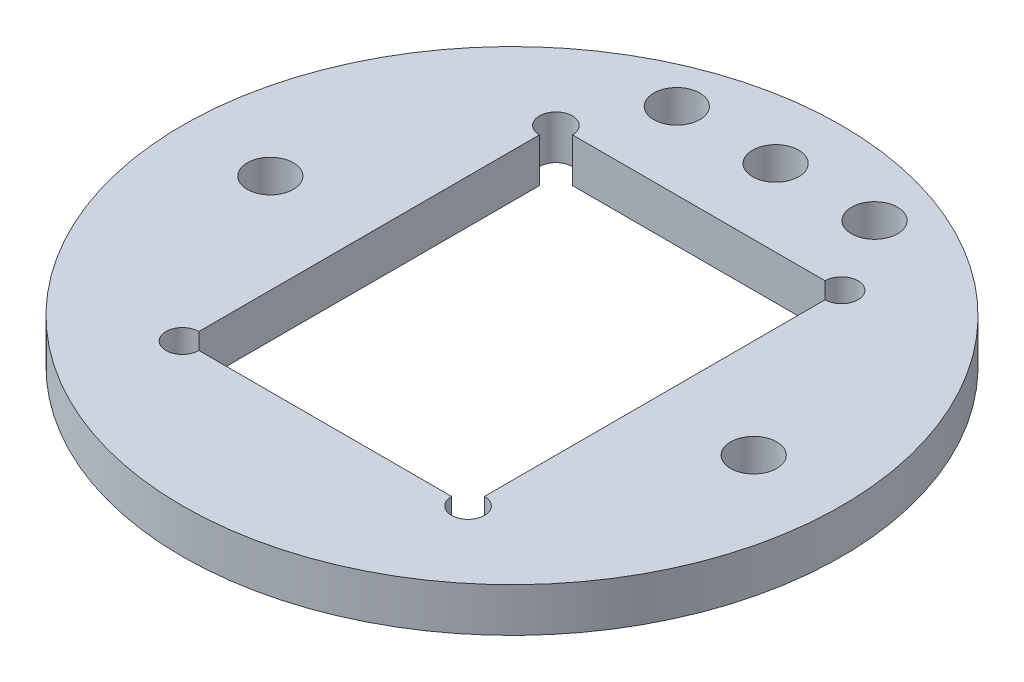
ISO-10303-21;
HEADER;
FILE_DESCRIPTION(('STEP AP214'),'2;1');
FILE_NAME('part.step','',(''),(''),'','','');
FILE_SCHEMA(('AUTOMOTIVE_DESIGN { 1 0 10303 214 1 1 1 1 }'));
ENDSEC;
DATA;
#1=APPLICATION_CONTEXT('core data for automotive mechanical design processes');
#2=APPLICATION_PROTOCOL_DEFINITION('international standard','automotive_design',2000,#1);
#3=PRODUCT_CONTEXT('',#1,'mechanical');
#4=PRODUCT('Part','Part','',(#3));
#5=PRODUCT_RELATED_PRODUCT_CATEGORY('part','',(#4));
#6=PRODUCT_DEFINITION_FORMATION('','',#4);
#7=PRODUCT_DEFINITION_CONTEXT('part definition',#1,'design');
#8=PRODUCT_DEFINITION('design','',#6,#7);
#9=PRODUCT_DEFINITION_SHAPE('','',#8);
#10=(LENGTH_UNIT() NAMED_UNIT(*) SI_UNIT(.MILLI.,.METRE.));
#11=(NAMED_UNIT(*) PLANE_ANGLE_UNIT() SI_UNIT($,.RADIAN.));
#12=(NAMED_UNIT(*) SI_UNIT($,.STERADIAN.) SOLID_ANGLE_UNIT());
#13=UNCERTAINTY_MEASURE_WITH_UNIT(LENGTH_MEASURE(1.E-05),#10,'distance_accuracy_value','');
#14=(GEOMETRIC_REPRESENTATION_CONTEXT(3) GLOBAL_UNCERTAINTY_ASSIGNED_CONTEXT((#13)) GLOBAL_UNIT_ASSIGNED_CONTEXT((#10,
#11,#12)) REPRESENTATION_CONTEXT('',''));
#15=CARTESIAN_POINT('',(0.,0.,0.));
#16=DIRECTION('',(0.,0.,1.));
#17=DIRECTION('',(1.,0.,0.));
#18=AXIS2_PLACEMENT_3D('',#15,#16,#17);
#19=CARTESIAN_POINT('',(0.,0.508,0.));
#20=DIRECTION('',(0.,1.,0.));
#21=DIRECTION('',(0.,0.,1.));
#22=AXIS2_PLACEMENT_3D('',#19,#20,#21);
#23=PLANE('',#22);
#24=CARTESIAN_POINT('',(1.651,0.508,-2.159));
#25=DIRECTION('',(0.,1.,0.));
#26=DIRECTION('',(0.,0.,1.));
#27=AXIS2_PLACEMENT_3D('',#24,#25,#26);
#28=CIRCLE('',#27,0.1905);
#29=CARTESIAN_POINT('',(1.651,0.508,-1.9685));
#30=VERTEX_POINT('',#29);
#31=CARTESIAN_POINT('',(1.4605,0.508,-2.159));
#32=VERTEX_POINT('',#31);
#33=EDGE_CURVE('E55',#30,#32,#28,.T.);
#34=ORIENTED_EDGE('',*,*,#33,.F.);
#35=DIRECTION('',(0.,0.,-1.));
#36=VECTOR('',#35,1.);
#37=CARTESIAN_POINT('',(1.651,0.508,-1.9685));
#38=LINE('',#37,#36);
#39=CARTESIAN_POINT('',(1.651,0.508,1.9685));
#40=VERTEX_POINT('',#39);
#41=EDGE_CURVE('E125',#40,#30,#38,.T.);
#42=ORIENTED_EDGE('',*,*,#41,.F.);
#43=CARTESIAN_POINT('',(1.651,0.508,2.159));
#44=DIRECTION('',(0.,1.,0.));
#45=DIRECTION('',(0.,0.,1.));
#46=AXIS2_PLACEMENT_3D('',#43,#44,#45);
#47=CIRCLE('',#46,0.1905);
#48=CARTESIAN_POINT('',(1.4605,0.508,2.159));
#49=VERTEX_POINT('',#48);
#50=EDGE_CURVE('E128',#49,#40,#47,.T.);
#51=ORIENTED_EDGE('',*,*,#50,.F.);
#52=DIRECTION('',(1.,0.,0.));
#53=VECTOR('',#52,1.);
#54=CARTESIAN_POINT('',(-1.4605,0.508,2.159));
#55=LINE('',#54,#53);
#56=CARTESIAN_POINT('',(-1.4605,0.508,2.159));
#57=VERTEX_POINT('',#56);
#58=EDGE_CURVE('E157',#57,#49,#55,.T.);
#59=ORIENTED_EDGE('',*,*,#58,.F.);
#60=CARTESIAN_POINT('',(-1.651,0.508,2.159));
#61=DIRECTION('',(0.,1.,0.));
#62=DIRECTION('',(0.,0.,1.));
#63=AXIS2_PLACEMENT_3D('',#60,#61,#62);
#64=CIRCLE('',#63,0.1905);
#65=CARTESIAN_POINT('',(-1.651,0.508,1.9685));
#66=VERTEX_POINT('',#65);
#67=EDGE_CURVE('E154',#66,#57,#64,.T.);
#68=ORIENTED_EDGE('',*,*,#67,.F.);
#69=DIRECTION('',(0.,0.,1.));
#70=VECTOR('',#69,1.);
#71=CARTESIAN_POINT('',(-1.651,0.508,-1.9685));
#72=LINE('',#71,#70);
#73=CARTESIAN_POINT('',(-1.651,0.508,-1.9685));
#74=VERTEX_POINT('',#73);
#75=EDGE_CURVE('E151',#74,#66,#72,.T.);
#76=ORIENTED_EDGE('',*,*,#75,.F.);
#77=CARTESIAN_POINT('',(-1.651,0.508,-2.159));
#78=DIRECTION('',(0.,1.,0.));
#79=DIRECTION('',(0.,0.,1.));
#80=AXIS2_PLACEMENT_3D('',#77,#78,#79);
#81=CIRCLE('',#80,0.1905);
#82=CARTESIAN_POINT('',(-1.4605,0.508,-2.159));
#83=VERTEX_POINT('',#82);
#84=EDGE_CURVE('E148',#83,#74,#81,.T.);
#85=ORIENTED_EDGE('',*,*,#84,.F.);
#86=DIRECTION('',(-1.,0.,0.));
#87=VECTOR('',#86,1.);
#88=CARTESIAN_POINT('',(-1.4605,0.508,-2.159));
#89=LINE('',#88,#87);
#90=EDGE_CURVE('E145',#32,#83,#89,.T.);
#91=ORIENTED_EDGE('',*,*,#90,.F.);
#92=EDGE_LOOP('',(#34,#42,#51,#59,#68,#76,#85,#91));
#93=FACE_BOUND('',#92,.T.);
#94=CARTESIAN_POINT('',(-1.143,0.508,-3.048));
#95=DIRECTION('',(0.,-1.,0.));
#96=DIRECTION('',(0.,0.,-1.));
#97=AXIS2_PLACEMENT_3D('',#94,#95,#96);
#98=CIRCLE('',#97,0.2667);
#99=CARTESIAN_POINT('',(-1.143,0.508,-3.3147));
#100=VERTEX_POINT('',#99);
#101=EDGE_CURVE('E164',#100,#100,#98,.T.);
#102=ORIENTED_EDGE('',*,*,#101,.T.);
#103=EDGE_LOOP('',(#102));
#104=FACE_BOUND('',#103,.T.);
#105=CARTESIAN_POINT('',(1.143,0.508,-3.048));
#106=DIRECTION('',(0.,-1.,0.));
#107=DIRECTION('',(0.,0.,-1.));
#108=AXIS2_PLACEMENT_3D('',#105,#106,#107);
#109=CIRCLE('',#108,0.2667);
#110=CARTESIAN_POINT('',(1.143,0.508,-3.3147));
#111=VERTEX_POINT('',#110);
#112=EDGE_CURVE('E179',#111,#111,#109,.T.);
#113=ORIENTED_EDGE('',*,*,#112,.T.);
#114=EDGE_LOOP('',(#113));
#115=FACE_BOUND('',#114,.T.);
#116=CARTESIAN_POINT('',(0.,0.508,-3.048));
#117=DIRECTION('',(0.,-1.,0.));
#118=DIRECTION('',(0.,0.,-1.));
#119=AXIS2_PLACEMENT_3D('',#116,#117,#118);
#120=CIRCLE('',#119,0.2667);
#121=CARTESIAN_POINT('',(0.,0.508,-3.3147));
#122=VERTEX_POINT('',#121);
#123=EDGE_CURVE('E185',#122,#122,#120,.T.);
#124=ORIENTED_EDGE('',*,*,#123,.T.);
#125=EDGE_LOOP('',(#124));
#126=FACE_BOUND('',#125,.T.);
#127=CARTESIAN_POINT('',(-2.794,0.508,0.));
#128=DIRECTION('',(0.,1.,0.));
#129=DIRECTION('',(0.,0.,1.));
#130=AXIS2_PLACEMENT_3D('',#127,#128,#129);
#131=CIRCLE('',#130,0.2667);
#132=CARTESIAN_POINT('',(-2.794,0.508,0.2667));
#133=VERTEX_POINT('',#132);
#134=EDGE_CURVE('E196',#133,#133,#131,.T.);
#135=ORIENTED_EDGE('',*,*,#134,.F.);
#136=EDGE_LOOP('',(#135));
#137=FACE_BOUND('',#136,.T.);
#138=CARTESIAN_POINT('',(2.794,0.508,0.));
#139=DIRECTION('',(0.,1.,0.));
#140=DIRECTION('',(0.,0.,1.));
#141=AXIS2_PLACEMENT_3D('',#138,#139,#140);
#142=CIRCLE('',#141,0.2667);
#143=CARTESIAN_POINT('',(2.794,0.508,0.266699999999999));
#144=VERTEX_POINT('',#143);
#145=EDGE_CURVE('E202',#144,#144,#142,.T.);
#146=ORIENTED_EDGE('',*,*,#145,.F.);
#147=EDGE_LOOP('',(#146));
#148=FACE_BOUND('',#147,.T.);
#149=CARTESIAN_POINT('',(0.,0.508,0.));
#150=DIRECTION('',(0.,1.,0.));
#151=DIRECTION('',(0.,0.,1.));
#152=AXIS2_PLACEMENT_3D('',#149,#150,#151);
#153=CIRCLE('',#152,3.81);
#154=CARTESIAN_POINT('',(0.,0.508,3.81));
#155=VERTEX_POINT('',#154);
#156=EDGE_CURVE('E12',#155,#155,#153,.T.);
#157=ORIENTED_EDGE('',*,*,#156,.T.);
#158=EDGE_LOOP('',(#157));
#159=FACE_BOUND('',#158,.T.);
#160=ADVANCED_FACE('F40',(#93,#104,#115,#126,#137,#148,#159),#23,.T.);
#161=CARTESIAN_POINT('',(0.,0.,0.));
#162=DIRECTION('',(0.,1.,0.));
#163=DIRECTION('',(0.,0.,1.));
#164=AXIS2_PLACEMENT_3D('',#161,#162,#163);
#165=PLANE('',#164);
#166=DIRECTION('',(0.,0.,-1.));
#167=VECTOR('',#166,1.);
#168=CARTESIAN_POINT('',(1.651,0.,-1.9685));
#169=LINE('',#168,#167);
#170=CARTESIAN_POINT('',(1.651,0.,1.9685));
#171=VERTEX_POINT('',#170);
#172=CARTESIAN_POINT('',(1.651,0.,-1.9685));
#173=VERTEX_POINT('',#172);
#174=EDGE_CURVE('E113',#171,#173,#169,.T.);
#175=ORIENTED_EDGE('',*,*,#174,.T.);
#176=CARTESIAN_POINT('',(1.651,0.,-2.159));
#177=DIRECTION('',(0.,1.,0.));
#178=DIRECTION('',(0.,0.,1.));
#179=AXIS2_PLACEMENT_3D('',#176,#177,#178);
#180=CIRCLE('',#179,0.1905);
#181=CARTESIAN_POINT('',(1.4605,0.,-2.159));
#182=VERTEX_POINT('',#181);
#183=EDGE_CURVE('E107',#173,#182,#180,.T.);
#184=ORIENTED_EDGE('',*,*,#183,.T.);
#185=DIRECTION('',(-1.,0.,0.));
#186=VECTOR('',#185,1.);
#187=CARTESIAN_POINT('',(-1.4605,0.,-2.159));
#188=LINE('',#187,#186);
#189=CARTESIAN_POINT('',(-1.4605,0.,-2.159));
#190=VERTEX_POINT('',#189);
#191=EDGE_CURVE('E116',#182,#190,#188,.T.);
#192=ORIENTED_EDGE('',*,*,#191,.T.);
#193=CARTESIAN_POINT('',(-1.651,0.,-2.159));
#194=DIRECTION('',(0.,1.,0.));
#195=DIRECTION('',(0.,0.,1.));
#196=AXIS2_PLACEMENT_3D('',#193,#194,#195);
#197=CIRCLE('',#196,0.1905);
#198=CARTESIAN_POINT('',(-1.651,0.,-1.9685));
#199=VERTEX_POINT('',#198);
#200=EDGE_CURVE('E63',#190,#199,#197,.T.);
#201=ORIENTED_EDGE('',*,*,#200,.T.);
#202=DIRECTION('',(0.,0.,1.));
#203=VECTOR('',#202,1.);
#204=CARTESIAN_POINT('',(-1.651,0.,-1.9685));
#205=LINE('',#204,#203);
#206=CARTESIAN_POINT('',(-1.651,0.,1.9685));
#207=VERTEX_POINT('',#206);
#208=EDGE_CURVE('E132',#199,#207,#205,.T.);
#209=ORIENTED_EDGE('',*,*,#208,.T.);
#210=CARTESIAN_POINT('',(-1.651,0.,2.159));
#211=DIRECTION('',(0.,1.,0.));
#212=DIRECTION('',(0.,0.,1.));
#213=AXIS2_PLACEMENT_3D('',#210,#211,#212);
#214=CIRCLE('',#213,0.1905);
#215=CARTESIAN_POINT('',(-1.4605,0.,2.159));
#216=VERTEX_POINT('',#215);
#217=EDGE_CURVE('E135',#207,#216,#214,.T.);
#218=ORIENTED_EDGE('',*,*,#217,.T.);
#219=DIRECTION('',(1.,0.,0.));
#220=VECTOR('',#219,1.);
#221=CARTESIAN_POINT('',(-1.4605,0.,2.159));
#222=LINE('',#221,#220);
#223=CARTESIAN_POINT('',(1.4605,0.,2.159));
#224=VERTEX_POINT('',#223);
#225=EDGE_CURVE('E138',#216,#224,#222,.T.);
#226=ORIENTED_EDGE('',*,*,#225,.T.);
#227=CARTESIAN_POINT('',(1.651,0.,2.159));
#228=DIRECTION('',(0.,1.,0.));
#229=DIRECTION('',(0.,0.,1.));
#230=AXIS2_PLACEMENT_3D('',#227,#228,#229);
#231=CIRCLE('',#230,0.1905);
#232=EDGE_CURVE('E141',#224,#171,#231,.T.);
#233=ORIENTED_EDGE('',*,*,#232,.T.);
#234=EDGE_LOOP('',(#175,#184,#192,#201,#209,#218,#226,#233));
#235=FACE_BOUND('',#234,.T.);
#236=CARTESIAN_POINT('',(-1.143,0.,-3.048));
#237=DIRECTION('',(0.,-1.,0.));
#238=DIRECTION('',(0.,0.,-1.));
#239=AXIS2_PLACEMENT_3D('',#236,#237,#238);
#240=CIRCLE('',#239,0.2667);
#241=CARTESIAN_POINT('',(-1.143,0.,-3.3147));
#242=VERTEX_POINT('',#241);
#243=EDGE_CURVE('E176',#242,#242,#240,.T.);
#244=ORIENTED_EDGE('',*,*,#243,.F.);
#245=EDGE_LOOP('',(#244));
#246=FACE_BOUND('',#245,.T.);
#247=CARTESIAN_POINT('',(1.143,0.,-3.048));
#248=DIRECTION('',(0.,-1.,0.));
#249=DIRECTION('',(0.,0.,-1.));
#250=AXIS2_PLACEMENT_3D('',#247,#248,#249);
#251=CIRCLE('',#250,0.2667);
#252=CARTESIAN_POINT('',(1.143,0.,-3.3147));
#253=VERTEX_POINT('',#252);
#254=EDGE_CURVE('E182',#253,#253,#251,.T.);
#255=ORIENTED_EDGE('',*,*,#254,.F.);
#256=EDGE_LOOP('',(#255));
#257=FACE_BOUND('',#256,.T.);
#258=CARTESIAN_POINT('',(0.,0.,-3.048));
#259=DIRECTION('',(0.,-1.,0.));
#260=DIRECTION('',(0.,0.,-1.));
#261=AXIS2_PLACEMENT_3D('',#258,#259,#260);
#262=CIRCLE('',#261,0.2667);
#263=CARTESIAN_POINT('',(0.,0.,-3.3147));
#264=VERTEX_POINT('',#263);
#265=EDGE_CURVE('E188',#264,#264,#262,.T.);
#266=ORIENTED_EDGE('',*,*,#265,.F.);
#267=EDGE_LOOP('',(#266));
#268=FACE_BOUND('',#267,.T.);
#269=CARTESIAN_POINT('',(-2.794,0.,0.));
#270=DIRECTION('',(0.,1.,0.));
#271=DIRECTION('',(0.,0.,1.));
#272=AXIS2_PLACEMENT_3D('',#269,#270,#271);
#273=CIRCLE('',#272,0.2667);
#274=CARTESIAN_POINT('',(-2.794,0.,0.2667));
#275=VERTEX_POINT('',#274);
#276=EDGE_CURVE('E191',#275,#275,#273,.T.);
#277=ORIENTED_EDGE('',*,*,#276,.T.);
#278=EDGE_LOOP('',(#277));
#279=FACE_BOUND('',#278,.T.);
#280=CARTESIAN_POINT('',(2.794,0.,0.));
#281=DIRECTION('',(0.,1.,0.));
#282=DIRECTION('',(0.,0.,1.));
#283=AXIS2_PLACEMENT_3D('',#280,#281,#282);
#284=CIRCLE('',#283,0.2667);
#285=CARTESIAN_POINT('',(2.794,0.,0.266699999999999));
#286=VERTEX_POINT('',#285);
#287=EDGE_CURVE('E199',#286,#286,#284,.T.);
#288=ORIENTED_EDGE('',*,*,#287,.T.);
#289=EDGE_LOOP('',(#288));
#290=FACE_BOUND('',#289,.T.);
#291=CARTESIAN_POINT('',(0.,0.,0.));
#292=DIRECTION('',(0.,1.,0.));
#293=DIRECTION('',(0.,0.,1.));
#294=AXIS2_PLACEMENT_3D('',#291,#292,#293);
#295=CIRCLE('',#294,3.81);
#296=CARTESIAN_POINT('',(0.,0.,3.81));
#297=VERTEX_POINT('',#296);
#298=EDGE_CURVE('E44',#297,#297,#295,.T.);
#299=ORIENTED_EDGE('',*,*,#298,.F.);
#300=EDGE_LOOP('',(#299));
#301=FACE_BOUND('',#300,.T.);
#302=ADVANCED_FACE('F121',(#235,#246,#257,#268,#279,#290,#301),#165,.F.);
#303=CARTESIAN_POINT('',(0.,0.508,0.));
#304=DIRECTION('',(0.,-1.,0.));
#305=DIRECTION('',(0.,0.,-1.));
#306=AXIS2_PLACEMENT_3D('',#303,#304,#305);
#307=CYLINDRICAL_SURFACE('',#306,3.81);
#308=ORIENTED_EDGE('',*,*,#156,.F.);
#309=EDGE_LOOP('',(#308));
#310=FACE_BOUND('',#309,.T.);
#311=ORIENTED_EDGE('',*,*,#298,.T.);
#312=EDGE_LOOP('',(#311));
#313=FACE_BOUND('',#312,.T.);
#314=ADVANCED_FACE('F42',(#310,#313),#307,.T.);
#315=CARTESIAN_POINT('',(2.794,0.,0.));
#316=DIRECTION('',(0.,1.,0.));
#317=DIRECTION('',(0.,0.,1.));
#318=AXIS2_PLACEMENT_3D('',#315,#316,#317);
#319=CYLINDRICAL_SURFACE('',#318,0.2667);
#320=ORIENTED_EDGE('',*,*,#145,.T.);
#321=EDGE_LOOP('',(#320));
#322=FACE_BOUND('',#321,.T.);
#323=ORIENTED_EDGE('',*,*,#287,.F.);
#324=EDGE_LOOP('',(#323));
#325=FACE_BOUND('',#324,.T.);
#326=ADVANCED_FACE('F215',(#322,#325),#319,.F.);
#327=CARTESIAN_POINT('',(-2.794,0.,0.));
#328=DIRECTION('',(0.,1.,0.));
#329=DIRECTION('',(0.,0.,1.));
#330=AXIS2_PLACEMENT_3D('',#327,#328,#329);
#331=CYLINDRICAL_SURFACE('',#330,0.2667);
#332=ORIENTED_EDGE('',*,*,#134,.T.);
#333=EDGE_LOOP('',(#332));
#334=FACE_BOUND('',#333,.T.);
#335=ORIENTED_EDGE('',*,*,#276,.F.);
#336=EDGE_LOOP('',(#335));
#337=FACE_BOUND('',#336,.T.);
#338=ADVANCED_FACE('F222',(#334,#337),#331,.F.);
#339=CARTESIAN_POINT('',(0.,0.,-3.048));
#340=DIRECTION('',(0.,1.,0.));
#341=DIRECTION('',(0.,0.,1.));
#342=AXIS2_PLACEMENT_3D('',#339,#340,#341);
#343=CYLINDRICAL_SURFACE('',#342,0.2667);
#344=ORIENTED_EDGE('',*,*,#265,.T.);
#345=EDGE_LOOP('',(#344));
#346=FACE_BOUND('',#345,.T.);
#347=ORIENTED_EDGE('',*,*,#123,.F.);
#348=EDGE_LOOP('',(#347));
#349=FACE_BOUND('',#348,.T.);
#350=ADVANCED_FACE('F225',(#346,#349),#343,.F.);
#351=CARTESIAN_POINT('',(1.143,0.,-3.048));
#352=DIRECTION('',(0.,1.,0.));
#353=DIRECTION('',(0.,0.,1.));
#354=AXIS2_PLACEMENT_3D('',#351,#352,#353);
#355=CYLINDRICAL_SURFACE('',#354,0.2667);
#356=ORIENTED_EDGE('',*,*,#254,.T.);
#357=EDGE_LOOP('',(#356));
#358=FACE_BOUND('',#357,.T.);
#359=ORIENTED_EDGE('',*,*,#112,.F.);
#360=EDGE_LOOP('',(#359));
#361=FACE_BOUND('',#360,.T.);
#362=ADVANCED_FACE('F229',(#358,#361),#355,.F.);
#363=CARTESIAN_POINT('',(-1.143,0.,-3.048));
#364=DIRECTION('',(0.,1.,0.));
#365=DIRECTION('',(0.,0.,1.));
#366=AXIS2_PLACEMENT_3D('',#363,#364,#365);
#367=CYLINDRICAL_SURFACE('',#366,0.2667);
#368=ORIENTED_EDGE('',*,*,#243,.T.);
#369=EDGE_LOOP('',(#368));
#370=FACE_BOUND('',#369,.T.);
#371=ORIENTED_EDGE('',*,*,#101,.F.);
#372=EDGE_LOOP('',(#371));
#373=FACE_BOUND('',#372,.T.);
#374=ADVANCED_FACE('F233',(#370,#373),#367,.F.);
#375=CARTESIAN_POINT('',(1.651,0.,-2.159));
#376=DIRECTION('',(0.,1.,0.));
#377=DIRECTION('',(0.,0.,1.));
#378=AXIS2_PLACEMENT_3D('',#375,#376,#377);
#379=CYLINDRICAL_SURFACE('',#378,0.1905);
#380=ORIENTED_EDGE('',*,*,#33,.T.);
#381=DIRECTION('',(0.,1.,0.));
#382=VECTOR('',#381,1.);
#383=CARTESIAN_POINT('',(1.4605,0.,-2.159));
#384=LINE('',#383,#382);
#385=EDGE_CURVE('E103',#182,#32,#384,.T.);
#386=ORIENTED_EDGE('',*,*,#385,.F.);
#387=ORIENTED_EDGE('',*,*,#183,.F.);
#388=DIRECTION('',(0.,1.,0.));
#389=VECTOR('',#388,1.);
#390=CARTESIAN_POINT('',(1.651,0.,-1.9685));
#391=LINE('',#390,#389);
#392=EDGE_CURVE('E162',#173,#30,#391,.T.);
#393=ORIENTED_EDGE('',*,*,#392,.T.);
#394=EDGE_LOOP('',(#380,#386,#387,#393));
#395=FACE_BOUND('',#394,.T.);
#396=ADVANCED_FACE('F105',(#395),#379,.F.);
#397=CARTESIAN_POINT('',(1.651,0.,-1.9685));
#398=DIRECTION('',(1.,0.,0.));
#399=DIRECTION('',(0.,0.,-1.));
#400=AXIS2_PLACEMENT_3D('',#397,#398,#399);
#401=PLANE('',#400);
#402=ORIENTED_EDGE('',*,*,#41,.T.);
#403=ORIENTED_EDGE('',*,*,#392,.F.);
#404=ORIENTED_EDGE('',*,*,#174,.F.);
#405=DIRECTION('',(0.,1.,0.));
#406=VECTOR('',#405,1.);
#407=CARTESIAN_POINT('',(1.651,0.,1.9685));
#408=LINE('',#407,#406);
#409=EDGE_CURVE('E165',#171,#40,#408,.T.);
#410=ORIENTED_EDGE('',*,*,#409,.T.);
#411=EDGE_LOOP('',(#402,#403,#404,#410));
#412=FACE_BOUND('',#411,.T.);
#413=ADVANCED_FACE('F240',(#412),#401,.F.);
#414=CARTESIAN_POINT('',(1.651,0.,2.159));
#415=DIRECTION('',(0.,1.,0.));
#416=DIRECTION('',(0.,0.,1.));
#417=AXIS2_PLACEMENT_3D('',#414,#415,#416);
#418=CYLINDRICAL_SURFACE('',#417,0.1905);
#419=ORIENTED_EDGE('',*,*,#50,.T.);
#420=ORIENTED_EDGE('',*,*,#409,.F.);
#421=ORIENTED_EDGE('',*,*,#232,.F.);
#422=DIRECTION('',(0.,1.,0.));
#423=VECTOR('',#422,1.);
#424=CARTESIAN_POINT('',(1.4605,0.,2.159));
#425=LINE('',#424,#423);
#426=EDGE_CURVE('E167',#224,#49,#425,.T.);
#427=ORIENTED_EDGE('',*,*,#426,.T.);
#428=EDGE_LOOP('',(#419,#420,#421,#427));
#429=FACE_BOUND('',#428,.T.);
#430=ADVANCED_FACE('F257',(#429),#418,.F.);
#431=CARTESIAN_POINT('',(-1.4605,0.,2.159));
#432=DIRECTION('',(0.,0.,1.));
#433=DIRECTION('',(1.,0.,0.));
#434=AXIS2_PLACEMENT_3D('',#431,#432,#433);
#435=PLANE('',#434);
#436=ORIENTED_EDGE('',*,*,#58,.T.);
#437=ORIENTED_EDGE('',*,*,#426,.F.);
#438=ORIENTED_EDGE('',*,*,#225,.F.);
#439=DIRECTION('',(0.,1.,0.));
#440=VECTOR('',#439,1.);
#441=CARTESIAN_POINT('',(-1.4605,0.,2.159));
#442=LINE('',#441,#440);
#443=EDGE_CURVE('E169',#216,#57,#442,.T.);
#444=ORIENTED_EDGE('',*,*,#443,.T.);
#445=EDGE_LOOP('',(#436,#437,#438,#444));
#446=FACE_BOUND('',#445,.T.);
#447=ADVANCED_FACE('F253',(#446),#435,.F.);
#448=CARTESIAN_POINT('',(-1.651,0.,2.159));
#449=DIRECTION('',(0.,1.,0.));
#450=DIRECTION('',(0.,0.,1.));
#451=AXIS2_PLACEMENT_3D('',#448,#449,#450);
#452=CYLINDRICAL_SURFACE('',#451,0.1905);
#453=ORIENTED_EDGE('',*,*,#67,.T.);
#454=ORIENTED_EDGE('',*,*,#443,.F.);
#455=ORIENTED_EDGE('',*,*,#217,.F.);
#456=DIRECTION('',(0.,1.,0.));
#457=VECTOR('',#456,1.);
#458=CARTESIAN_POINT('',(-1.651,0.,1.9685));
#459=LINE('',#458,#457);
#460=EDGE_CURVE('E171',#207,#66,#459,.T.);
#461=ORIENTED_EDGE('',*,*,#460,.T.);
#462=EDGE_LOOP('',(#453,#454,#455,#461));
#463=FACE_BOUND('',#462,.T.);
#464=ADVANCED_FACE('F249',(#463),#452,.F.);
#465=CARTESIAN_POINT('',(-1.651,0.,-1.9685));
#466=DIRECTION('',(-1.,0.,0.));
#467=DIRECTION('',(0.,0.,1.));
#468=AXIS2_PLACEMENT_3D('',#465,#466,#467);
#469=PLANE('',#468);
#470=ORIENTED_EDGE('',*,*,#75,.T.);
#471=ORIENTED_EDGE('',*,*,#460,.F.);
#472=ORIENTED_EDGE('',*,*,#208,.F.);
#473=DIRECTION('',(0.,1.,0.));
#474=VECTOR('',#473,1.);
#475=CARTESIAN_POINT('',(-1.651,0.,-1.9685));
#476=LINE('',#475,#474);
#477=EDGE_CURVE('E173',#199,#74,#476,.T.);
#478=ORIENTED_EDGE('',*,*,#477,.T.);
#479=EDGE_LOOP('',(#470,#471,#472,#478));
#480=FACE_BOUND('',#479,.T.);
#481=ADVANCED_FACE('F246',(#480),#469,.F.);
#482=CARTESIAN_POINT('',(-1.651,0.,-2.159));
#483=DIRECTION('',(0.,1.,0.));
#484=DIRECTION('',(0.,0.,1.));
#485=AXIS2_PLACEMENT_3D('',#482,#483,#484);
#486=CYLINDRICAL_SURFACE('',#485,0.1905);
#487=ORIENTED_EDGE('',*,*,#84,.T.);
#488=ORIENTED_EDGE('',*,*,#477,.F.);
#489=ORIENTED_EDGE('',*,*,#200,.F.);
#490=DIRECTION('',(0.,1.,0.));
#491=VECTOR('',#490,1.);
#492=CARTESIAN_POINT('',(-1.4605,0.,-2.159));
#493=LINE('',#492,#491);
#494=EDGE_CURVE('E112',#190,#83,#493,.T.);
#495=ORIENTED_EDGE('',*,*,#494,.T.);
#496=EDGE_LOOP('',(#487,#488,#489,#495));
#497=FACE_BOUND('',#496,.T.);
#498=ADVANCED_FACE('F243',(#497),#486,.F.);
#499=CARTESIAN_POINT('',(-1.4605,0.,-2.159));
#500=DIRECTION('',(0.,0.,-1.));
#501=DIRECTION('',(-1.,0.,0.));
#502=AXIS2_PLACEMENT_3D('',#499,#500,#501);
#503=PLANE('',#502);
#504=ORIENTED_EDGE('',*,*,#90,.T.);
#505=ORIENTED_EDGE('',*,*,#494,.F.);
#506=ORIENTED_EDGE('',*,*,#191,.F.);
#507=ORIENTED_EDGE('',*,*,#385,.T.);
#508=EDGE_LOOP('',(#504,#505,#506,#507));
#509=FACE_BOUND('',#508,.T.);
#510=ADVANCED_FACE('F117',(#509),#503,.F.);
#511=CLOSED_SHELL('',(#160,#302,#314,#326,#338,#350,#362,#374,#396,#413,#430,#447,#464,#481,
#498,#510));
#512=MANIFOLD_SOLID_BREP('B2',#511);
#513=ADVANCED_BREP_SHAPE_REPRESENTATION('',(#18,#512),#14);
#514=SHAPE_DEFINITION_REPRESENTATION(#9,#513);
ENDSEC;
END-ISO-10303-21;
